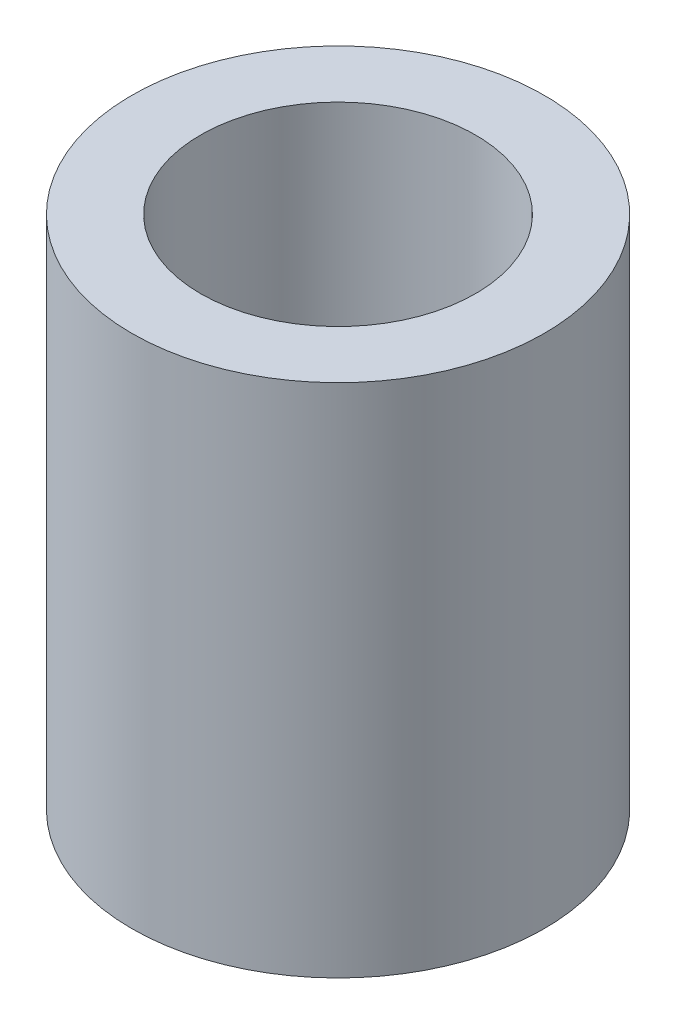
ISO-10303-21;
HEADER;
FILE_DESCRIPTION(('STEP AP214'),'2;1');
FILE_NAME('part.step','',(''),(''),'','','');
FILE_SCHEMA(('AUTOMOTIVE_DESIGN { 1 0 10303 214 1 1 1 1 }'));
ENDSEC;
DATA;
#1=APPLICATION_CONTEXT('core data for automotive mechanical design processes');
#2=APPLICATION_PROTOCOL_DEFINITION('international standard','automotive_design',2000,#1);
#3=PRODUCT_CONTEXT('',#1,'mechanical');
#4=PRODUCT('Part','Part','',(#3));
#5=PRODUCT_RELATED_PRODUCT_CATEGORY('part','',(#4));
#6=PRODUCT_DEFINITION_FORMATION('','',#4);
#7=PRODUCT_DEFINITION_CONTEXT('part definition',#1,'design');
#8=PRODUCT_DEFINITION('design','',#6,#7);
#9=PRODUCT_DEFINITION_SHAPE('','',#8);
#10=(LENGTH_UNIT() NAMED_UNIT(*) SI_UNIT(.MILLI.,.METRE.));
#11=(NAMED_UNIT(*) PLANE_ANGLE_UNIT() SI_UNIT($,.RADIAN.));
#12=(NAMED_UNIT(*) SI_UNIT($,.STERADIAN.) SOLID_ANGLE_UNIT());
#13=UNCERTAINTY_MEASURE_WITH_UNIT(LENGTH_MEASURE(1.E-05),#10,'distance_accuracy_value','');
#14=(GEOMETRIC_REPRESENTATION_CONTEXT(3) GLOBAL_UNCERTAINTY_ASSIGNED_CONTEXT((#13)) GLOBAL_UNIT_ASSIGNED_CONTEXT((#10,
#11,#12)) REPRESENTATION_CONTEXT('',''));
#15=CARTESIAN_POINT('',(0.,0.,0.));
#16=DIRECTION('',(0.,0.,1.));
#17=DIRECTION('',(1.,0.,0.));
#18=AXIS2_PLACEMENT_3D('',#15,#16,#17);
#19=CARTESIAN_POINT('',(0.,75.,0.));
#20=DIRECTION('',(0.,1.,0.));
#21=DIRECTION('',(0.,0.,1.));
#22=AXIS2_PLACEMENT_3D('',#19,#20,#21);
#23=PLANE('',#22);
#24=CARTESIAN_POINT('',(0.,75.,0.));
#25=DIRECTION('',(0.,1.,0.));
#26=DIRECTION('',(0.,0.,1.));
#27=AXIS2_PLACEMENT_3D('',#24,#25,#26);
#28=CIRCLE('',#27,30.);
#29=CARTESIAN_POINT('',(0.,75.,30.));
#30=VERTEX_POINT('',#29);
#31=EDGE_CURVE('E10',#30,#30,#28,.T.);
#32=ORIENTED_EDGE('',*,*,#31,.T.);
#33=EDGE_LOOP('',(#32));
#34=FACE_BOUND('',#33,.T.);
#35=CARTESIAN_POINT('',(0.,75.,0.));
#36=DIRECTION('',(0.,1.,0.));
#37=DIRECTION('',(0.,0.,1.));
#38=AXIS2_PLACEMENT_3D('',#35,#36,#37);
#39=CIRCLE('',#38,20.);
#40=CARTESIAN_POINT('',(0.,75.,20.));
#41=VERTEX_POINT('',#40);
#42=EDGE_CURVE('E40',#41,#41,#39,.T.);
#43=ORIENTED_EDGE('',*,*,#42,.F.);
#44=EDGE_LOOP('',(#43));
#45=FACE_BOUND('',#44,.T.);
#46=ADVANCED_FACE('F29',(#34,#45),#23,.T.);
#47=CARTESIAN_POINT('',(0.,0.,0.));
#48=DIRECTION('',(0.,1.,0.));
#49=DIRECTION('',(0.,0.,1.));
#50=AXIS2_PLACEMENT_3D('',#47,#48,#49);
#51=PLANE('',#50);
#52=CARTESIAN_POINT('',(0.,0.,0.));
#53=DIRECTION('',(0.,1.,0.));
#54=DIRECTION('',(0.,0.,1.));
#55=AXIS2_PLACEMENT_3D('',#52,#53,#54);
#56=CIRCLE('',#55,30.);
#57=CARTESIAN_POINT('',(0.,0.,30.));
#58=VERTEX_POINT('',#57);
#59=EDGE_CURVE('E33',#58,#58,#56,.T.);
#60=ORIENTED_EDGE('',*,*,#59,.F.);
#61=EDGE_LOOP('',(#60));
#62=FACE_BOUND('',#61,.T.);
#63=CARTESIAN_POINT('',(0.,0.,0.));
#64=DIRECTION('',(0.,1.,0.));
#65=DIRECTION('',(0.,0.,1.));
#66=AXIS2_PLACEMENT_3D('',#63,#64,#65);
#67=CIRCLE('',#66,20.);
#68=CARTESIAN_POINT('',(0.,0.,20.));
#69=VERTEX_POINT('',#68);
#70=EDGE_CURVE('E42',#69,#69,#67,.T.);
#71=ORIENTED_EDGE('',*,*,#70,.T.);
#72=EDGE_LOOP('',(#71));
#73=FACE_BOUND('',#72,.T.);
#74=ADVANCED_FACE('F52',(#62,#73),#51,.F.);
#75=CARTESIAN_POINT('',(0.,75.,0.));
#76=DIRECTION('',(0.,-1.,0.));
#77=DIRECTION('',(0.,0.,-1.));
#78=AXIS2_PLACEMENT_3D('',#75,#76,#77);
#79=CYLINDRICAL_SURFACE('',#78,30.);
#80=ORIENTED_EDGE('',*,*,#31,.F.);
#81=EDGE_LOOP('',(#80));
#82=FACE_BOUND('',#81,.T.);
#83=ORIENTED_EDGE('',*,*,#59,.T.);
#84=EDGE_LOOP('',(#83));
#85=FACE_BOUND('',#84,.T.);
#86=ADVANCED_FACE('F31',(#82,#85),#79,.T.);
#87=CARTESIAN_POINT('',(0.,75.,0.));
#88=DIRECTION('',(0.,-1.,0.));
#89=DIRECTION('',(0.,0.,-1.));
#90=AXIS2_PLACEMENT_3D('',#87,#88,#89);
#91=CYLINDRICAL_SURFACE('',#90,20.);
#92=ORIENTED_EDGE('',*,*,#42,.T.);
#93=EDGE_LOOP('',(#92));
#94=FACE_BOUND('',#93,.T.);
#95=ORIENTED_EDGE('',*,*,#70,.F.);
#96=EDGE_LOOP('',(#95));
#97=FACE_BOUND('',#96,.T.);
#98=ADVANCED_FACE('F48',(#94,#97),#91,.F.);
#99=CLOSED_SHELL('',(#46,#74,#86,#98));
#100=MANIFOLD_SOLID_BREP('B2',#99);
#101=ADVANCED_BREP_SHAPE_REPRESENTATION('',(#18,#100),#14);
#102=SHAPE_DEFINITION_REPRESENTATION(#9,#101);
ENDSEC;
END-ISO-10303-21;
